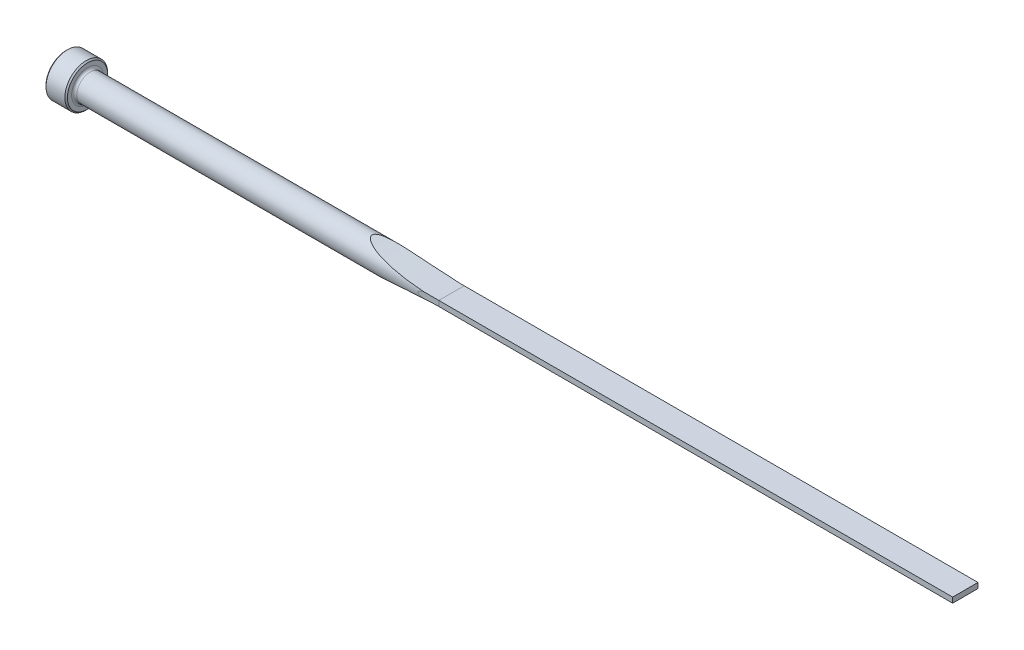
from build123d import *

# Parameters (mm, degrees)
CUT_EXTRUDE1_DEPTH = 267.851147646
CUT_EXTRUDE2_DEPTH = 267.851147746
FILLET1_R          = 0.762
CHAMFER1_SIZE      = 0.381


with BuildPart() as part:
    # Sketch1 → Revolve1 (revolve)
    with BuildSketch(Plane.XY, mode=Mode.PRIVATE) as revolve1_sk:
        Polygon((0, 0), (0, 6.35), (6.35, 6.35), (6.35, 3.9624), (266.7, 3.9624), (266.7, 0), align=None)
    revolve(revolve1_sk.sketch.rotate(Axis((0, 0, 0), (1, 0, 0)), 90), axis=Axis((0, 0, 0), (1, 0, 0)))

    # Sketch2 → Cut-Extrude1 (cut, symmetric)
    with BuildSketch(Plane.XY):
        with BuildLine():
            Line((266.7, 3.9624), (266.7, 0.7874))
            Line((266.7, 0.7874), (114.3, 0.7874))
            ThreePointArc((114.3, 0.7874), (102.420237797, 1.584725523), (90.753569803, 3.9624))
            Line((90.753569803, 3.9624), (266.7, 3.9624))
        make_face()
    cut_extrude1 = extrude(amount=CUT_EXTRUDE1_DEPTH, both=True, mode=Mode.SUBTRACT)

    # Mirror1: Cut-Extrude1 across plane
    add(cut_extrude1.mirror(Plane.ZX), mode=Mode.SUBTRACT)

    # Sketch3 → Cut-Extrude2 (cut, symmetric)
    with BuildSketch(Plane(origin=(0, 0, 0), x_dir=(1, 0, 0), z_dir=(0, 1, 0))):
        with BuildLine():
            Line((266.7, 3.9624), (266.7, 3.7592))
            Line((266.7, 3.7592), (114.3, 3.7592))
            ThreePointArc((114.3, 3.7592), (111.29463147, 3.810014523), (108.292698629, 3.9624))
            Line((108.292698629, 3.9624), (266.7, 3.9624))
        make_face()
    cut_extrude2 = extrude(amount=CUT_EXTRUDE2_DEPTH, both=True, mode=Mode.SUBTRACT)

    # Mirror2: Cut-Extrude2 across plane
    add(cut_extrude2.mirror(Plane.XY), mode=Mode.SUBTRACT)

    # Fillet1
    fillet1_edges = [part.edges().sort_by_distance(p)[0] for p in [
        (6.35, 0, -3.9624),
    ]]
    fillet(fillet1_edges, radius=FILLET1_R)

    # Chamfer1
    chamfer1_edges = [part.edges().sort_by_distance(p)[0] for p in [
        (6.35, 0, -6.35),
        (0, 0, -6.35),
    ]]
    chamfer(chamfer1_edges, length=CHAMFER1_SIZE)


solid = part.part
